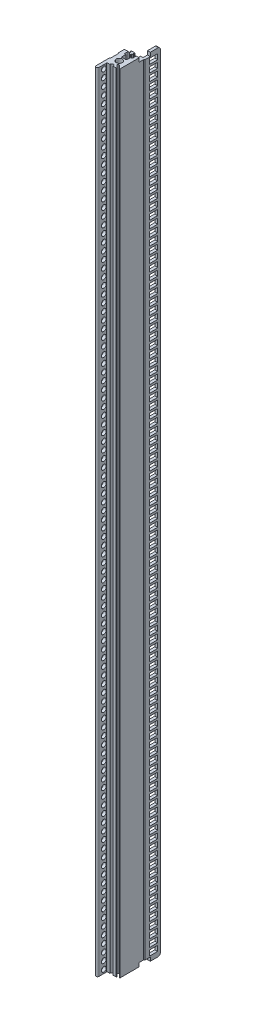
from build123d import *

# Parameters (mm, degrees)
SKETCH_1_R          = 1.6
EXTRUDE_1_DEPTH     = 266.7
SKETCH_8_W          = 5.4
SKETCH_8_H          = 2.5
SKETCH_8_H_2        = 1.2
CUT_EXTRUDE_6_DEPTH = 534.63429425
FILLET_2_R          = 0.2
EXTRUDE_2_DEPTH     = 533.4
SKETCH_2_R          = 2.1
CUT_EXTRUDE_1_DEPTH = 10
CUT_EXTRUDE_START   = -10
SKETCH_3_R          = 2.1
CUT_EXTRUDE_2_DEPTH = 10
SKETCH_4_R          = 1.65
CUT_EXTRUDE_3_DEPTH = 12
SKETCH_5_W          = 7
SKETCH_5_H          = 2.54
CUT_EXTRUDE_4_DEPTH = 268.853299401
SKETCH_7_W          = 5.5
SKETCH_7_H          = 3.6
CUT_EXTRUDE_5_DEPTH = 10
FILLET_1_R          = 2


with BuildPart() as part:
    # Sketch 1 → Extrude 1 (new, symmetric)
    with BuildSketch(Plane(origin=(0, 0, 0), x_dir=(1, 0, 0), z_dir=(0, 1, 0))):
        with BuildLine():
            Line((-4.20000049, 11.89999994), (-3.89999944, 11.899999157))
            ThreePointArc((-3.89999944, 11.899999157), (-3.758578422, 11.841420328), (-3.699999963, 11.699999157))
            Line((-3.699999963, 11.699999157), (-3.699999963, 9.94999994))
            ThreePointArc((-3.699999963, 9.94999994), (-3.758578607, 9.808578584), (-3.899999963, 9.74999994))
            Line((-3.899999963, 9.74999994), (-4.25, 9.74999994))
            ThreePointArc((-4.25, 9.74999994), (-4.391421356, 9.691421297), (-4.45, 9.54999994))
            Line((-4.45, 9.54999994), (-4.45, 8.5))
            Line((-4.45, 8.5), (-4.7, 8.5))
            Line((-4.7, 8.5), (-5, 8.2))
            Line((-5, 8.2), (-5, 7.4))
            Line((-5, 7.4), (-5, 4.4))
            Line((-5, 4.4), (-4.549867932, 3.899804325))
            Line((-4.549867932, 3.899804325), (-4.550132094, -1.100195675))
            Line((-4.550132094, -1.100195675), (-5, -1.6))
            Line((-5, -1.6), (-5, -10.75))
            ThreePointArc((-5, -10.75), (-4, -11.75), (-3, -10.75))
            Line((-3, -10.75), (-3, -5.75))
            ThreePointArc((-3, -5.75), (-2.853553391, -5.396446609), (-2.5, -5.25))
            Line((-2.5, -5.25), (-1.15000013, -5.25))
            ThreePointArc((-1.15000013, -5.25), (-1.079289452, -5.220710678), (-1.05000013, -5.15))
            Line((-1.05000013, -5.15), (-1.05000013, -5))
            ThreePointArc((-1.05000013, -5), (-1.3e-07, -3.95), (1.04999987, -5))
            Line((1.04999987, -5), (1.04999987, -5.15))
            ThreePointArc((1.04999987, -5.15), (1.079289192, -5.220710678), (1.14999987, -5.25))
            Line((1.14999987, -5.25), (3.070348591, -5.25))
            ThreePointArc((3.070348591, -5.25), (3.255124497, -5.126536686), (3.211769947, -4.908578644))
            Line((3.211769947, -4.908578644), (1.688730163, -3.385538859))
            ThreePointArc((1.688730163, -3.385538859), (1.688730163, -2.537010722), (2.5372583, -2.537010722))
            Line((2.5372583, -2.537010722), (4.658578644, -4.658331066))
            ThreePointArc((4.658578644, -4.658331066), (4.876536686, -4.701685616), (5, -4.516909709))
            Line((5, -4.516909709), (5, -2.080961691))
            Line((5, -2.080961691), (5, 5.179349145))
            Line((5, 5.179349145), (5, 15))
            Line((5, 15), (3.59999987, 15))
            Line((3.59999987, 15), (3.59999987, 12.5))
            Line((3.59999987, 12.5), (1.94999987, 12.5))
            Line((1.94999987, 12.5), (1.94999987, 10.55))
            Line((1.94999987, 10.55), (2.84999987, 10.55))
            Line((2.84999987, 10.55), (2.84999987, 9.35))
            Line((2.84999987, 9.35), (1.94999987, 9.35))
            Line((1.94999987, 9.35), (1.94999987, 8.35))
            Line((1.94999987, 8.35), (2.84999987, 8.35))
            Line((2.84999987, 8.35), (2.84999987, 6.05))
            Line((2.84999987, 6.05), (1.94999987, 6.05))
            Line((1.94999987, 6.05), (1.94999987, 3.885550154))
            ThreePointArc((1.94999987, 3.885550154), (1.567454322, 3.098943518), (0.71249987, 2.914162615))
            ThreePointArc((0.71249987, 2.914162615), (-0.242015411, 2.990222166), (-1.17187513, 2.761649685))
            ThreePointArc((-1.17187513, 2.761649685), (-1.360397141, 2.778988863), (-1.45000013, 2.945759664))
            Line((-1.45000013, 2.945759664), (-1.45000013, 6.05))
            Line((-1.45000013, 6.05), (-2.35000013, 6.05))
            Line((-2.35000013, 6.05), (-2.35000013, 8.35))
            Line((-2.35000013, 8.35), (-1.45000013, 8.35))
            Line((-1.45000013, 8.35), (-1.45000013, 9.35))
            Line((-1.45000013, 9.35), (-2.35000013, 9.35))
            Line((-2.35000013, 9.35), (-2.35000013, 10.55))
            Line((-2.35000013, 10.55), (-1.300000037, 10.55))
            Line((-1.300000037, 10.55), (-1.300000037, 10.617157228))
            ThreePointArc((-1.300000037, 10.617157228), (-1.315224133, 10.693693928), (-1.358578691, 10.758578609))
            Line((-1.358578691, 10.758578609), (-1.941421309, 11.341421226))
            ThreePointArc((-1.941421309, 11.341421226), (-1.984775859, 11.406305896), (-1.999999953, 11.482842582))
            Line((-1.999999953, 11.482842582), (-1.999999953, 11.699999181))
            ThreePointArc((-1.999999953, 11.699999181), (-1.941421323, 11.841420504), (-1.8, 11.899999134))
            Line((-1.8, 11.899999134), (-1.7, 11.899999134))
            ThreePointArc((-1.7, 11.899999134), (-1.558578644, 11.958577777), (-1.5, 12.099999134))
            Line((-1.5, 12.099999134), (-1.5, 12.199999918))
            ThreePointArc((-1.5, 12.199999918), (-1.558578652, 12.341421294), (-1.700000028, 12.399999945))
            Line((-1.700000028, 12.399999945), (-1.867157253, 12.399999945))
            ThreePointArc((-1.867157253, 12.399999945), (-1.943693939, 12.415224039), (-2.008578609, 12.458578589))
            Line((-2.008578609, 12.458578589), (-2.050000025, 12.500000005))
            Line((-2.050000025, 12.500000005), (-3.849999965, 12.500000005))
            Line((-3.849999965, 12.500000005), (-3.891421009, 12.458578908))
            ThreePointArc((-3.891421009, 12.458578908), (-3.95630571, 12.415224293), (-4.032842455, 12.400000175))
            Line((-4.032842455, 12.400000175), (-4.199999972, 12.400000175))
            ThreePointArc((-4.199999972, 12.400000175), (-4.341421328, 12.341421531), (-4.399999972, 12.200000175))
            Line((-4.399999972, 12.200000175), (-4.399999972, 12.099999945))
            ThreePointArc((-4.399999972, 12.099999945), (-4.341421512, 11.95857877), (-4.20000049, 11.89999994))
        make_face()
        with Locations(Location((-1.3e-07, 0, 0), (0, 0, 270))):
            Circle(SKETCH_1_R, mode=Mode.SUBTRACT)
    extrude(amount=EXTRUDE_1_DEPTH, both=True)

    # Sketch 8 → Cut-Extrude 6 (cut, through all)
    with BuildSketch(Plane(origin=(0, -266.7, 0), x_dir=(-1, 0, 0), z_dir=(0, -1, 0))):
        with Locations((-0.24999987, 7.1)):
            Rectangle(SKETCH_8_W, SKETCH_8_H)
        with Locations((-0.24999987, 9.95)):
            Rectangle(SKETCH_8_W, SKETCH_8_H_2)
    extrude(amount=-CUT_EXTRUDE_6_DEPTH, mode=Mode.SUBTRACT)

    # Fillet 2
    fillet_2_edges = [part.edges().sort_by_distance(p)[0] for p in [
        (-2.45000013, 0, -5.85),
        (2.94999987, 0, -8.35),
        (2.94999987, 0, -5.85),
        (-2.45000013, 0, -8.35),
        (-2.45000013, 0, -9.35),
        (2.94999987, 0, -10.55),
        (2.94999987, 0, -9.35),
        (-2.45000013, 0, -10.55),
    ]]
    fillet(fillet_2_edges, radius=FILLET_2_R)

    # Sketch 6 → Extrude 2 (add)
    with BuildSketch(Plane(origin=(0, 266.7, 0), x_dir=(1, 0, 0), z_dir=(0, 1, 0))):
        Polygon((3.59999987, 12.5), (3.59999987, 22.5), (5.5, 22.5), (5.5, 12), (5, 11.5), align=None)
    extrude(amount=-EXTRUDE_2_DEPTH)

    # Sketch 2 → Cut-Extrude 1 (cut)
    with BuildSketch(Plane(origin=(0, 266.7, 0), x_dir=(1, 0, 0), z_dir=(0, 1, 0))):
        with Locations(Location((0, 0, 0), (0, 0, 270))):
            Circle(SKETCH_2_R)
    extrude(amount=-CUT_EXTRUDE_1_DEPTH, mode=Mode.SUBTRACT)

    # Sketch 3 → Cut-Extrude 2 (cut)
    with BuildSketch(Plane.XZ.offset(266.7).offset(CUT_EXTRUDE_START)):
        with Locations(Location((0, 0, 0), (0, 0, 90))):
            Circle(SKETCH_3_R)
    extrude(amount=CUT_EXTRUDE_2_DEPTH, mode=Mode.SUBTRACT)

    # Sketch 4 → Cut-Extrude 3 (cut)
    with BuildSketch(Plane.ZY.offset(5)):
        with Locations((7.5, -264.16)):
            Circle(SKETCH_4_R)
        with Locations((7.5, -259.08)):
            Circle(SKETCH_4_R)
        with Locations((7.5, -254)):
            Circle(SKETCH_4_R)
        with Locations((7.5, -248.92)):
            Circle(SKETCH_4_R)
        with Locations((7.5, -243.84)):
            Circle(SKETCH_4_R)
        with Locations((7.5, -238.76)):
            Circle(SKETCH_4_R)
        with Locations((7.5, -233.68)):
            Circle(SKETCH_4_R)
        with Locations((7.5, -228.6)):
            Circle(SKETCH_4_R)
        with Locations((7.5, -223.52)):
            Circle(SKETCH_4_R)
        with Locations((7.5, -218.44)):
            Circle(SKETCH_4_R)
        with Locations((7.5, -213.36)):
            Circle(SKETCH_4_R)
        with Locations((7.5, -208.28)):
            Circle(SKETCH_4_R)
        with Locations((7.5, -203.2)):
            Circle(SKETCH_4_R)
        with Locations((7.5, -198.12)):
            Circle(SKETCH_4_R)
        with Locations((7.5, -193.04)):
            Circle(SKETCH_4_R)
        with Locations((7.5, -187.96)):
            Circle(SKETCH_4_R)
        with Locations((7.5, -182.88)):
            Circle(SKETCH_4_R)
        with Locations((7.5, -177.8)):
            Circle(SKETCH_4_R)
        with Locations((7.5, -172.72)):
            Circle(SKETCH_4_R)
        with Locations((7.5, -167.64)):
            Circle(SKETCH_4_R)
        with Locations((7.5, -162.56)):
            Circle(SKETCH_4_R)
        with Locations((7.5, -157.48)):
            Circle(SKETCH_4_R)
        with Locations((7.5, -152.4)):
            Circle(SKETCH_4_R)
        with Locations((7.5, -147.32)):
            Circle(SKETCH_4_R)
        with Locations((7.5, -142.24)):
            Circle(SKETCH_4_R)
        with Locations((7.5, -137.16)):
            Circle(SKETCH_4_R)
        with Locations((7.5, -132.08)):
            Circle(SKETCH_4_R)
        with Locations((7.5, -127)):
            Circle(SKETCH_4_R)
        with Locations((7.5, -121.92)):
            Circle(SKETCH_4_R)
        with Locations((7.5, -116.84)):
            Circle(SKETCH_4_R)
        with Locations((7.5, -111.76)):
            Circle(SKETCH_4_R)
        with Locations((7.5, -106.68)):
            Circle(SKETCH_4_R)
        with Locations((7.5, -101.6)):
            Circle(SKETCH_4_R)
        with Locations((7.5, -96.52)):
            Circle(SKETCH_4_R)
        with Locations((7.5, -91.44)):
            Circle(SKETCH_4_R)
        with Locations((7.5, -86.36)):
            Circle(SKETCH_4_R)
        with Locations((7.5, -81.28)):
            Circle(SKETCH_4_R)
        with Locations((7.5, -76.2)):
            Circle(SKETCH_4_R)
        with Locations((7.5, -71.12)):
            Circle(SKETCH_4_R)
        with Locations((7.5, -66.04)):
            Circle(SKETCH_4_R)
        with Locations((7.5, -60.96)):
            Circle(SKETCH_4_R)
        with Locations((7.5, -55.88)):
            Circle(SKETCH_4_R)
        with Locations((7.5, -50.8)):
            Circle(SKETCH_4_R)
        with Locations((7.5, -45.72)):
            Circle(SKETCH_4_R)
        with Locations((7.5, -40.64)):
            Circle(SKETCH_4_R)
        with Locations((7.5, -35.56)):
            Circle(SKETCH_4_R)
        with Locations((7.5, -30.48)):
            Circle(SKETCH_4_R)
        with Locations((7.5, -25.4)):
            Circle(SKETCH_4_R)
        with Locations((7.5, -20.32)):
            Circle(SKETCH_4_R)
        with Locations((7.5, -15.24)):
            Circle(SKETCH_4_R)
        with Locations((7.5, -10.16)):
            Circle(SKETCH_4_R)
        with Locations((7.5, -5.08)):
            Circle(SKETCH_4_R)
        with Locations((7.5, 0)):
            Circle(SKETCH_4_R)
        with Locations((7.5, 5.08)):
            Circle(SKETCH_4_R)
        with Locations((7.5, 10.16)):
            Circle(SKETCH_4_R)
        with Locations((7.5, 15.24)):
            Circle(SKETCH_4_R)
        with Locations((7.5, 20.32)):
            Circle(SKETCH_4_R)
        with Locations((7.5, 25.4)):
            Circle(SKETCH_4_R)
        with Locations((7.5, 30.48)):
            Circle(SKETCH_4_R)
        with Locations((7.5, 35.56)):
            Circle(SKETCH_4_R)
        with Locations((7.5, 40.64)):
            Circle(SKETCH_4_R)
        with Locations((7.5, 45.72)):
            Circle(SKETCH_4_R)
        with Locations((7.5, 50.8)):
            Circle(SKETCH_4_R)
        with Locations((7.5, 55.88)):
            Circle(SKETCH_4_R)
        with Locations((7.5, 60.96)):
            Circle(SKETCH_4_R)
        with Locations((7.5, 66.04)):
            Circle(SKETCH_4_R)
        with Locations((7.5, 71.12)):
            Circle(SKETCH_4_R)
        with Locations((7.5, 76.2)):
            Circle(SKETCH_4_R)
        with Locations((7.5, 81.28)):
            Circle(SKETCH_4_R)
        with Locations((7.5, 86.36)):
            Circle(SKETCH_4_R)
        with Locations((7.5, 91.44)):
            Circle(SKETCH_4_R)
        with Locations((7.5, 96.52)):
            Circle(SKETCH_4_R)
        with Locations((7.5, 101.6)):
            Circle(SKETCH_4_R)
        with Locations((7.5, 106.68)):
            Circle(SKETCH_4_R)
        with Locations((7.5, 111.76)):
            Circle(SKETCH_4_R)
        with Locations((7.5, 116.84)):
            Circle(SKETCH_4_R)
        with Locations((7.5, 121.92)):
            Circle(SKETCH_4_R)
        with Locations((7.5, 127)):
            Circle(SKETCH_4_R)
        with Locations((7.5, 132.08)):
            Circle(SKETCH_4_R)
        with Locations((7.5, 137.16)):
            Circle(SKETCH_4_R)
        with Locations((7.5, 142.24)):
            Circle(SKETCH_4_R)
        with Locations((7.5, 147.32)):
            Circle(SKETCH_4_R)
        with Locations((7.5, 152.4)):
            Circle(SKETCH_4_R)
        with Locations((7.5, 157.48)):
            Circle(SKETCH_4_R)
        with Locations((7.5, 162.56)):
            Circle(SKETCH_4_R)
        with Locations((7.5, 182.88)):
            Circle(SKETCH_4_R)
        with Locations((7.5, 177.8)):
            Circle(SKETCH_4_R)
        with Locations((7.5, 193.04)):
            Circle(SKETCH_4_R)
        with Locations((7.5, 243.84)):
            Circle(SKETCH_4_R)
        with Locations((7.5, 223.52)):
            Circle(SKETCH_4_R)
        with Locations((7.5, 172.72)):
            Circle(SKETCH_4_R)
        with Locations((7.5, 203.2)):
            Circle(SKETCH_4_R)
        with Locations((7.5, 187.96)):
            Circle(SKETCH_4_R)
        with Locations((7.5, 167.64)):
            Circle(SKETCH_4_R)
        with Locations((7.5, 218.44)):
            Circle(SKETCH_4_R)
        with Locations((7.5, 248.92)):
            Circle(SKETCH_4_R)
        with Locations((7.5, 254)):
            Circle(SKETCH_4_R)
        with Locations((7.5, 208.28)):
            Circle(SKETCH_4_R)
        with Locations((7.5, 213.36)):
            Circle(SKETCH_4_R)
        with Locations((7.5, 198.12)):
            Circle(SKETCH_4_R)
        with Locations((7.5, 233.68)):
            Circle(SKETCH_4_R)
        with Locations((7.5, 238.76)):
            Circle(SKETCH_4_R)
        with Locations((7.5, 228.6)):
            Circle(SKETCH_4_R)
        with Locations((7.5, 264.16)):
            Circle(SKETCH_4_R)
        with Locations((7.5, 259.08)):
            Circle(SKETCH_4_R)
    extrude(amount=-CUT_EXTRUDE_3_DEPTH, mode=Mode.SUBTRACT)

    # Sketch 5 → Cut-Extrude 4 (cut, through all)
    with BuildSketch(Plane(origin=(5.5, 0, 0), x_dir=(0, 0, -1), z_dir=(1, 0, 0))):
        with Locations((12, 265.43)):
            Rectangle(SKETCH_5_W, SKETCH_5_H)
        with Locations((12, -265.43)):
            Rectangle(SKETCH_5_W, SKETCH_5_H)
    extrude(amount=-CUT_EXTRUDE_4_DEPTH, mode=Mode.SUBTRACT)

    # Sketch 7 → Cut-Extrude 5 (cut)
    with BuildSketch(Plane(origin=(5.5, 0, 0), x_dir=(0, 0, -1), z_dir=(1, 0, 0))):
        with Locations((17.75, -261.62)):
            Rectangle(SKETCH_7_W, SKETCH_7_H)
        with Locations((17.75, -256.54)):
            Rectangle(SKETCH_7_W, SKETCH_7_H)
        with Locations((17.75, -251.46)):
            Rectangle(SKETCH_7_W, SKETCH_7_H)
        with Locations((17.75, -246.38)):
            Rectangle(SKETCH_7_W, SKETCH_7_H)
        with Locations((17.75, -241.3)):
            Rectangle(SKETCH_7_W, SKETCH_7_H)
        with Locations((17.75, -236.22)):
            Rectangle(SKETCH_7_W, SKETCH_7_H)
        with Locations((17.75, -231.14)):
            Rectangle(SKETCH_7_W, SKETCH_7_H)
        with Locations((17.75, -226.06)):
            Rectangle(SKETCH_7_W, SKETCH_7_H)
        with Locations((17.75, -220.98)):
            Rectangle(SKETCH_7_W, SKETCH_7_H)
        with Locations((17.75, -215.9)):
            Rectangle(SKETCH_7_W, SKETCH_7_H)
        with Locations((17.75, -210.82)):
            Rectangle(SKETCH_7_W, SKETCH_7_H)
        with Locations((17.75, -205.74)):
            Rectangle(SKETCH_7_W, SKETCH_7_H)
        with Locations((17.75, -200.66)):
            Rectangle(SKETCH_7_W, SKETCH_7_H)
        with Locations((17.75, -195.58)):
            Rectangle(SKETCH_7_W, SKETCH_7_H)
        with Locations((17.75, -190.5)):
            Rectangle(SKETCH_7_W, SKETCH_7_H)
        with Locations((17.75, -185.42)):
            Rectangle(SKETCH_7_W, SKETCH_7_H)
        with Locations((17.75, -180.34)):
            Rectangle(SKETCH_7_W, SKETCH_7_H)
        with Locations((17.75, -175.26)):
            Rectangle(SKETCH_7_W, SKETCH_7_H)
        with Locations((17.75, -170.18)):
            Rectangle(SKETCH_7_W, SKETCH_7_H)
        with Locations((17.75, -165.1)):
            Rectangle(SKETCH_7_W, SKETCH_7_H)
        with Locations((17.75, -160.02)):
            Rectangle(SKETCH_7_W, SKETCH_7_H)
        with Locations((17.75, -154.94)):
            Rectangle(SKETCH_7_W, SKETCH_7_H)
        with Locations((17.75, -149.86)):
            Rectangle(SKETCH_7_W, SKETCH_7_H)
        with Locations((17.75, -144.78)):
            Rectangle(SKETCH_7_W, SKETCH_7_H)
        with Locations((17.75, -139.7)):
            Rectangle(SKETCH_7_W, SKETCH_7_H)
        with Locations((17.75, -134.62)):
            Rectangle(SKETCH_7_W, SKETCH_7_H)
        with Locations((17.75, -129.54)):
            Rectangle(SKETCH_7_W, SKETCH_7_H)
        with Locations((17.75, -124.46)):
            Rectangle(SKETCH_7_W, SKETCH_7_H)
        with Locations((17.75, -119.38)):
            Rectangle(SKETCH_7_W, SKETCH_7_H)
        with Locations((17.75, -114.3)):
            Rectangle(SKETCH_7_W, SKETCH_7_H)
        with Locations((17.75, -109.22)):
            Rectangle(SKETCH_7_W, SKETCH_7_H)
        with Locations((17.75, -104.14)):
            Rectangle(SKETCH_7_W, SKETCH_7_H)
        with Locations((17.75, -99.06)):
            Rectangle(SKETCH_7_W, SKETCH_7_H)
        with Locations((17.75, -93.98)):
            Rectangle(SKETCH_7_W, SKETCH_7_H)
        with Locations((17.75, -88.9)):
            Rectangle(SKETCH_7_W, SKETCH_7_H)
        with Locations((17.75, -83.82)):
            Rectangle(SKETCH_7_W, SKETCH_7_H)
        with Locations((17.75, -78.74)):
            Rectangle(SKETCH_7_W, SKETCH_7_H)
        with Locations((17.75, -73.66)):
            Rectangle(SKETCH_7_W, SKETCH_7_H)
        with Locations((17.75, -68.58)):
            Rectangle(SKETCH_7_W, SKETCH_7_H)
        with Locations((17.75, -63.5)):
            Rectangle(SKETCH_7_W, SKETCH_7_H)
        with Locations((17.75, -58.42)):
            Rectangle(SKETCH_7_W, SKETCH_7_H)
        with Locations((17.75, -53.34)):
            Rectangle(SKETCH_7_W, SKETCH_7_H)
        with Locations((17.75, -48.26)):
            Rectangle(SKETCH_7_W, SKETCH_7_H)
        with Locations((17.75, -43.18)):
            Rectangle(SKETCH_7_W, SKETCH_7_H)
        with Locations((17.75, -38.1)):
            Rectangle(SKETCH_7_W, SKETCH_7_H)
        with Locations((17.75, -33.02)):
            Rectangle(SKETCH_7_W, SKETCH_7_H)
        with Locations((17.75, -27.94)):
            Rectangle(SKETCH_7_W, SKETCH_7_H)
        with Locations((17.75, -22.86)):
            Rectangle(SKETCH_7_W, SKETCH_7_H)
        with Locations((17.75, -17.78)):
            Rectangle(SKETCH_7_W, SKETCH_7_H)
        with Locations((17.75, -12.7)):
            Rectangle(SKETCH_7_W, SKETCH_7_H)
        with Locations((17.75, -7.62)):
            Rectangle(SKETCH_7_W, SKETCH_7_H)
        with Locations((17.75, -2.54)):
            Rectangle(SKETCH_7_W, SKETCH_7_H)
        with Locations((17.75, 2.54)):
            Rectangle(SKETCH_7_W, SKETCH_7_H)
        with Locations((17.75, 7.62)):
            Rectangle(SKETCH_7_W, SKETCH_7_H)
        with Locations((17.75, 12.7)):
            Rectangle(SKETCH_7_W, SKETCH_7_H)
        with Locations((17.75, 17.78)):
            Rectangle(SKETCH_7_W, SKETCH_7_H)
        with Locations((17.75, 22.86)):
            Rectangle(SKETCH_7_W, SKETCH_7_H)
        with Locations((17.75, 27.94)):
            Rectangle(SKETCH_7_W, SKETCH_7_H)
        with Locations((17.75, 33.02)):
            Rectangle(SKETCH_7_W, SKETCH_7_H)
        with Locations((17.75, 38.1)):
            Rectangle(SKETCH_7_W, SKETCH_7_H)
        with Locations((17.75, 43.18)):
            Rectangle(SKETCH_7_W, SKETCH_7_H)
        with Locations((17.75, 48.26)):
            Rectangle(SKETCH_7_W, SKETCH_7_H)
        with Locations((17.75, 53.34)):
            Rectangle(SKETCH_7_W, SKETCH_7_H)
        with Locations((17.75, 58.42)):
            Rectangle(SKETCH_7_W, SKETCH_7_H)
        with Locations((17.75, 63.5)):
            Rectangle(SKETCH_7_W, SKETCH_7_H)
        with Locations((17.75, 68.58)):
            Rectangle(SKETCH_7_W, SKETCH_7_H)
        with Locations((17.75, 73.66)):
            Rectangle(SKETCH_7_W, SKETCH_7_H)
        with Locations((17.75, 78.74)):
            Rectangle(SKETCH_7_W, SKETCH_7_H)
        with Locations((17.75, 83.82)):
            Rectangle(SKETCH_7_W, SKETCH_7_H)
        with Locations((17.75, 88.9)):
            Rectangle(SKETCH_7_W, SKETCH_7_H)
        with Locations((17.75, 93.98)):
            Rectangle(SKETCH_7_W, SKETCH_7_H)
        with Locations((17.75, 99.06)):
            Rectangle(SKETCH_7_W, SKETCH_7_H)
        with Locations((17.75, 104.14)):
            Rectangle(SKETCH_7_W, SKETCH_7_H)
        with Locations((17.75, 109.22)):
            Rectangle(SKETCH_7_W, SKETCH_7_H)
        with Locations((17.75, 114.3)):
            Rectangle(SKETCH_7_W, SKETCH_7_H)
        with Locations((17.75, 119.38)):
            Rectangle(SKETCH_7_W, SKETCH_7_H)
        with Locations((17.75, 124.46)):
            Rectangle(SKETCH_7_W, SKETCH_7_H)
        with Locations((17.75, 129.54)):
            Rectangle(SKETCH_7_W, SKETCH_7_H)
        with Locations((17.75, 134.62)):
            Rectangle(SKETCH_7_W, SKETCH_7_H)
        with Locations((17.75, 139.7)):
            Rectangle(SKETCH_7_W, SKETCH_7_H)
        with Locations((17.75, 144.78)):
            Rectangle(SKETCH_7_W, SKETCH_7_H)
        with Locations((17.75, 149.86)):
            Rectangle(SKETCH_7_W, SKETCH_7_H)
        with Locations((17.75, 154.94)):
            Rectangle(SKETCH_7_W, SKETCH_7_H)
        with Locations((17.75, 160.02)):
            Rectangle(SKETCH_7_W, SKETCH_7_H)
        with Locations((17.75, 165.1)):
            Rectangle(SKETCH_7_W, SKETCH_7_H)
        with Locations((17.75, 175.26)):
            Rectangle(SKETCH_7_W, SKETCH_7_H)
        with Locations((17.75, 185.42)):
            Rectangle(SKETCH_7_W, SKETCH_7_H)
        with Locations((17.75, 205.74)):
            Rectangle(SKETCH_7_W, SKETCH_7_H)
        with Locations((17.75, 210.82)):
            Rectangle(SKETCH_7_W, SKETCH_7_H)
        with Locations((17.75, 190.5)):
            Rectangle(SKETCH_7_W, SKETCH_7_H)
        with Locations((17.75, 180.34)):
            Rectangle(SKETCH_7_W, SKETCH_7_H)
        with Locations((17.75, 195.58)):
            Rectangle(SKETCH_7_W, SKETCH_7_H)
        with Locations((17.75, 170.18)):
            Rectangle(SKETCH_7_W, SKETCH_7_H)
        with Locations((17.75, 200.66)):
            Rectangle(SKETCH_7_W, SKETCH_7_H)
        with Locations((17.75, 215.9)):
            Rectangle(SKETCH_7_W, SKETCH_7_H)
        with Locations((17.75, 226.06)):
            Rectangle(SKETCH_7_W, SKETCH_7_H)
        with Locations((17.75, 236.22)):
            Rectangle(SKETCH_7_W, SKETCH_7_H)
        with Locations((17.75, 256.54)):
            Rectangle(SKETCH_7_W, SKETCH_7_H)
        with Locations((17.75, 261.62)):
            Rectangle(SKETCH_7_W, SKETCH_7_H)
        with Locations((17.75, 241.3)):
            Rectangle(SKETCH_7_W, SKETCH_7_H)
        with Locations((17.75, 231.14)):
            Rectangle(SKETCH_7_W, SKETCH_7_H)
        with Locations((17.75, 246.38)):
            Rectangle(SKETCH_7_W, SKETCH_7_H)
        with Locations((17.75, 220.98)):
            Rectangle(SKETCH_7_W, SKETCH_7_H)
        with Locations((17.75, 251.46)):
            Rectangle(SKETCH_7_W, SKETCH_7_H)
    extrude(amount=-CUT_EXTRUDE_5_DEPTH, mode=Mode.SUBTRACT)

    # Fillet 1
    fillet_1_edges = [part.edges().sort_by_distance(p)[0] for p in [
        (4.549999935, 266.7, -22.5),
        (4.549999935, -266.7, -22.5),
    ]]
    fillet(fillet_1_edges, radius=FILLET_1_R)


solid = part.part
